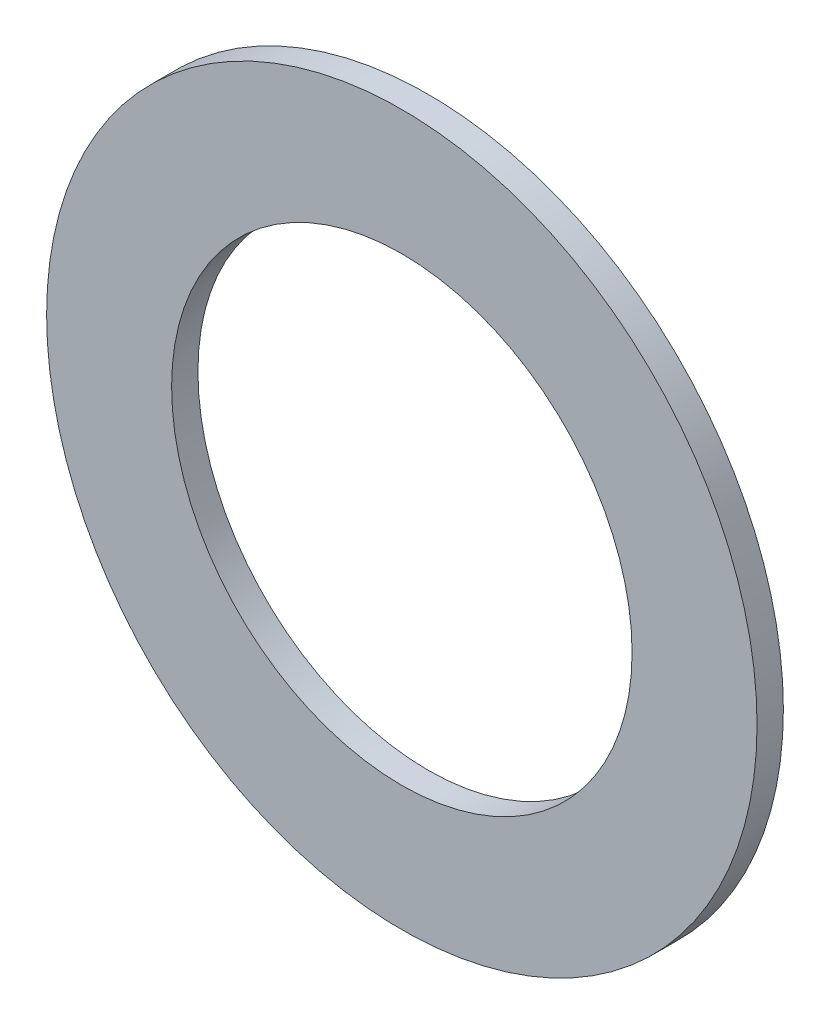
from build123d import *

# Parameters (mm, degrees)
SKETCH_1_R      = 27
SKETCH_1_R_2    = 17.5
EXTRUDE_1_DEPTH = 2


with BuildPart() as part:
    # Sketch 1 → Extrude 1 (new body)
    with BuildSketch(Plane(origin=(0, 0, 2), x_dir=(-1, 0, 0), z_dir=(0, 0, -1))):
        with Locations((-3, 52)):
            Circle(SKETCH_1_R)
        with Locations((-3, 52)):
            Circle(SKETCH_1_R_2, mode=Mode.SUBTRACT)
    extrude(amount=EXTRUDE_1_DEPTH)


solid = part.part
